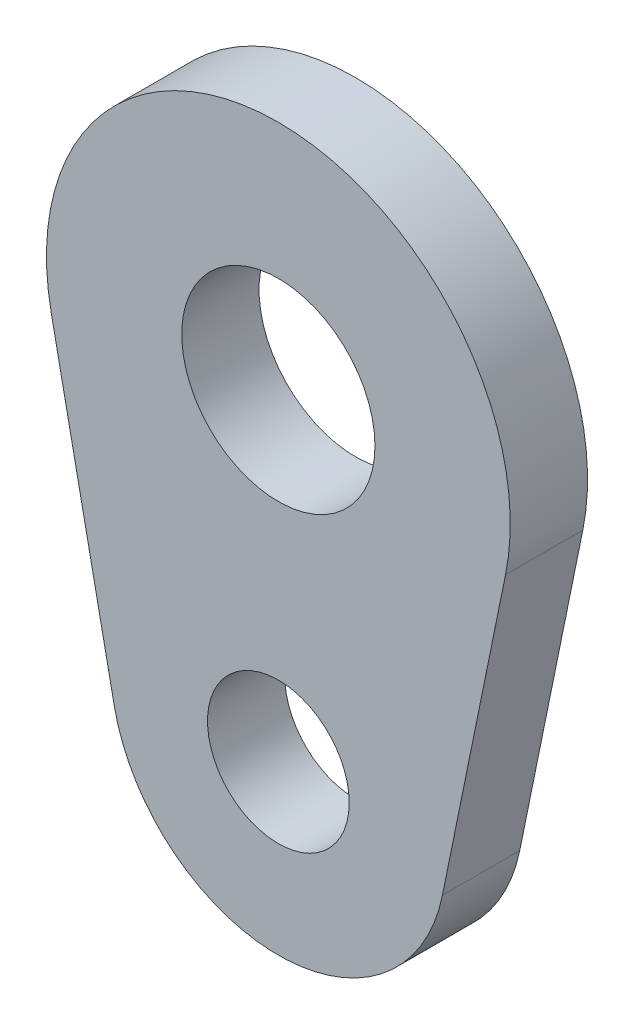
from build123d import *

# Parameters (mm, degrees)
ESQUISSE1_R      = 7.5
ESQUISSE1_R_2    = 5.5
EXTRUSION1_DEPTH = 6


with BuildPart() as part:
    # Esquisse1 → Extrusion1 (new body)
    with BuildSketch(Plane.XY):
        with BuildLine():
            Line((-17.636326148, -3.6), (-12.737346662, -27.6))
            ThreePointArc((-12.737346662, -27.6), (0, -38), (12.737346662, -27.6))
            Line((12.737346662, -27.6), (17.636326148, -3.6))
            ThreePointArc((17.636326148, -3.6), (0, 18), (-17.636326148, -3.6))
        make_face()
        Circle(ESQUISSE1_R, mode=Mode.SUBTRACT)
        with Locations((0, -25)):
            Circle(ESQUISSE1_R_2, mode=Mode.SUBTRACT)
    extrude(amount=EXTRUSION1_DEPTH)


solid = part.part
